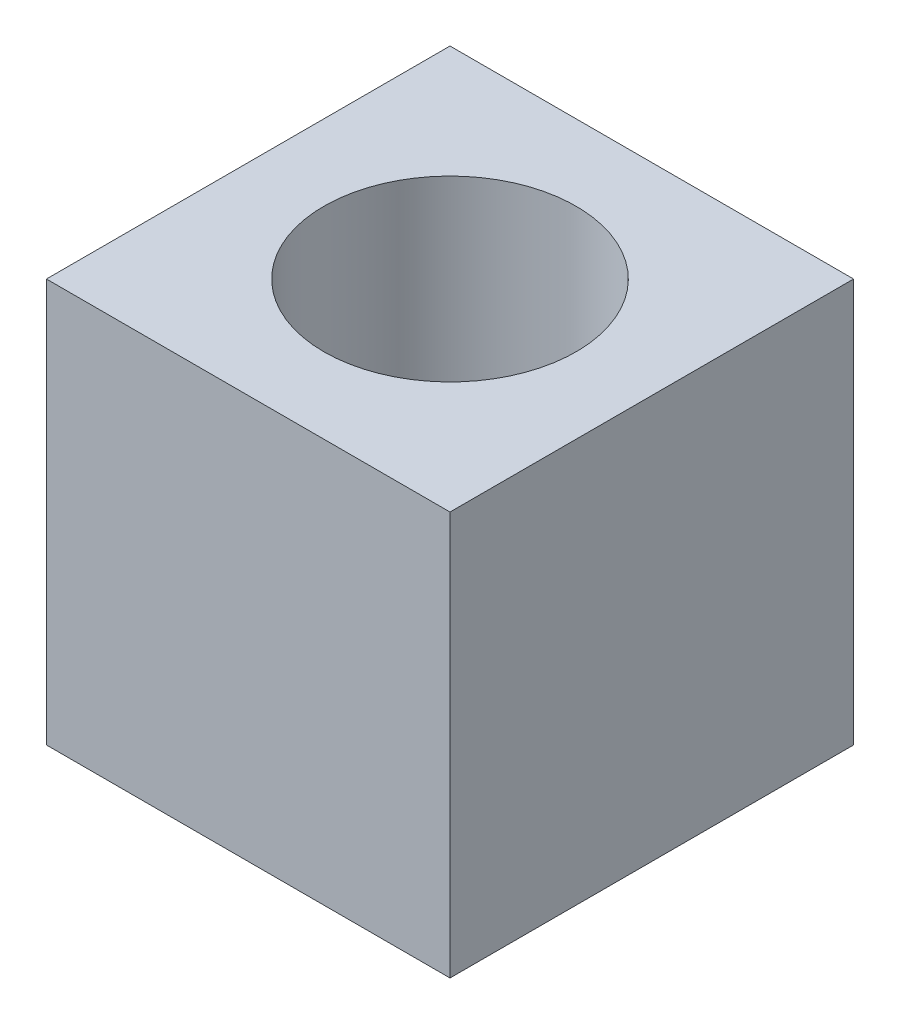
ISO-10303-21;
HEADER;
FILE_DESCRIPTION(('STEP AP214'),'2;1');
FILE_NAME('part.step','',(''),(''),'','','');
FILE_SCHEMA(('AUTOMOTIVE_DESIGN { 1 0 10303 214 1 1 1 1 }'));
ENDSEC;
DATA;
#1=APPLICATION_CONTEXT('core data for automotive mechanical design processes');
#2=APPLICATION_PROTOCOL_DEFINITION('international standard','automotive_design',2000,#1);
#3=PRODUCT_CONTEXT('',#1,'mechanical');
#4=PRODUCT('Part','Part','',(#3));
#5=PRODUCT_RELATED_PRODUCT_CATEGORY('part','',(#4));
#6=PRODUCT_DEFINITION_FORMATION('','',#4);
#7=PRODUCT_DEFINITION_CONTEXT('part definition',#1,'design');
#8=PRODUCT_DEFINITION('design','',#6,#7);
#9=PRODUCT_DEFINITION_SHAPE('','',#8);
#10=(LENGTH_UNIT() NAMED_UNIT(*) SI_UNIT(.MILLI.,.METRE.));
#11=(NAMED_UNIT(*) PLANE_ANGLE_UNIT() SI_UNIT($,.RADIAN.));
#12=(NAMED_UNIT(*) SI_UNIT($,.STERADIAN.) SOLID_ANGLE_UNIT());
#13=UNCERTAINTY_MEASURE_WITH_UNIT(LENGTH_MEASURE(1.E-05),#10,'distance_accuracy_value','');
#14=(GEOMETRIC_REPRESENTATION_CONTEXT(3) GLOBAL_UNCERTAINTY_ASSIGNED_CONTEXT((#13)) GLOBAL_UNIT_ASSIGNED_CONTEXT((#10,
#11,#12)) REPRESENTATION_CONTEXT('',''));
#15=CARTESIAN_POINT('',(0.,0.,0.));
#16=DIRECTION('',(0.,0.,1.));
#17=DIRECTION('',(1.,0.,0.));
#18=AXIS2_PLACEMENT_3D('',#15,#16,#17);
#19=CARTESIAN_POINT('',(-50.8,0.,50.8));
#20=DIRECTION('',(1.,0.,0.));
#21=DIRECTION('',(0.,0.,-1.));
#22=AXIS2_PLACEMENT_3D('',#19,#20,#21);
#23=PLANE('',#22);
#24=DIRECTION('',(0.,-1.,0.));
#25=VECTOR('',#24,1.);
#26=CARTESIAN_POINT('',(-50.8,0.,-50.8));
#27=LINE('',#26,#25);
#28=CARTESIAN_POINT('',(-50.8,101.6,-50.8));
#29=VERTEX_POINT('',#28);
#30=CARTESIAN_POINT('',(-50.8,0.,-50.8));
#31=VERTEX_POINT('',#30);
#32=EDGE_CURVE('E68',#29,#31,#27,.T.);
#33=ORIENTED_EDGE('',*,*,#32,.T.);
#34=DIRECTION('',(0.,0.,-1.));
#35=VECTOR('',#34,1.);
#36=CARTESIAN_POINT('',(-50.8,0.,50.8));
#37=LINE('',#36,#35);
#38=CARTESIAN_POINT('',(-50.8,0.,50.8));
#39=VERTEX_POINT('',#38);
#40=EDGE_CURVE('E11',#39,#31,#37,.T.);
#41=ORIENTED_EDGE('',*,*,#40,.F.);
#42=DIRECTION('',(0.,-1.,0.));
#43=VECTOR('',#42,1.);
#44=CARTESIAN_POINT('',(-50.8,0.,50.8));
#45=LINE('',#44,#43);
#46=CARTESIAN_POINT('',(-50.8,101.6,50.8));
#47=VERTEX_POINT('',#46);
#48=EDGE_CURVE('E91',#47,#39,#45,.T.);
#49=ORIENTED_EDGE('',*,*,#48,.F.);
#50=DIRECTION('',(0.,0.,-1.));
#51=VECTOR('',#50,1.);
#52=CARTESIAN_POINT('',(-50.8,101.6,50.8));
#53=LINE('',#52,#51);
#54=EDGE_CURVE('E80',#47,#29,#53,.T.);
#55=ORIENTED_EDGE('',*,*,#54,.T.);
#56=EDGE_LOOP('',(#33,#41,#49,#55));
#57=FACE_BOUND('',#56,.T.);
#58=ADVANCED_FACE('F24',(#57),#23,.F.);
#59=CARTESIAN_POINT('',(-50.8,0.,50.8));
#60=DIRECTION('',(0.,1.,0.));
#61=DIRECTION('',(0.,0.,1.));
#62=AXIS2_PLACEMENT_3D('',#59,#60,#61);
#63=PLANE('',#62);
#64=CARTESIAN_POINT('',(0.,0.,0.));
#65=DIRECTION('',(0.,1.,0.));
#66=DIRECTION('',(0.,0.,1.));
#67=AXIS2_PLACEMENT_3D('',#64,#65,#66);
#68=CIRCLE('',#67,31.75);
#69=CARTESIAN_POINT('',(0.,0.,31.75));
#70=VERTEX_POINT('',#69);
#71=EDGE_CURVE('E81',#70,#70,#68,.T.);
#72=ORIENTED_EDGE('',*,*,#71,.T.);
#73=EDGE_LOOP('',(#72));
#74=FACE_BOUND('',#73,.T.);
#75=DIRECTION('',(1.,0.,0.));
#76=VECTOR('',#75,1.);
#77=CARTESIAN_POINT('',(-50.8,0.,-50.8));
#78=LINE('',#77,#76);
#79=CARTESIAN_POINT('',(50.8,0.,-50.8));
#80=VERTEX_POINT('',#79);
#81=EDGE_CURVE('E64',#31,#80,#78,.T.);
#82=ORIENTED_EDGE('',*,*,#81,.T.);
#83=DIRECTION('',(0.,0.,-1.));
#84=VECTOR('',#83,1.);
#85=CARTESIAN_POINT('',(50.8,0.,50.8));
#86=LINE('',#85,#84);
#87=CARTESIAN_POINT('',(50.8,0.,50.8));
#88=VERTEX_POINT('',#87);
#89=EDGE_CURVE('E31',#88,#80,#86,.T.);
#90=ORIENTED_EDGE('',*,*,#89,.F.);
#91=DIRECTION('',(1.,0.,0.));
#92=VECTOR('',#91,1.);
#93=CARTESIAN_POINT('',(-50.8,0.,50.8));
#94=LINE('',#93,#92);
#95=EDGE_CURVE('E76',#39,#88,#94,.T.);
#96=ORIENTED_EDGE('',*,*,#95,.F.);
#97=ORIENTED_EDGE('',*,*,#40,.T.);
#98=EDGE_LOOP('',(#82,#90,#96,#97));
#99=FACE_BOUND('',#98,.T.);
#100=ADVANCED_FACE('F75',(#74,#99),#63,.F.);
#101=CARTESIAN_POINT('',(50.8,0.,50.8));
#102=DIRECTION('',(-1.,0.,0.));
#103=DIRECTION('',(0.,0.,1.));
#104=AXIS2_PLACEMENT_3D('',#101,#102,#103);
#105=PLANE('',#104);
#106=DIRECTION('',(0.,1.,0.));
#107=VECTOR('',#106,1.);
#108=CARTESIAN_POINT('',(50.8,0.,-50.8));
#109=LINE('',#108,#107);
#110=CARTESIAN_POINT('',(50.8,101.6,-50.8));
#111=VERTEX_POINT('',#110);
#112=EDGE_CURVE('E69',#80,#111,#109,.T.);
#113=ORIENTED_EDGE('',*,*,#112,.T.);
#114=DIRECTION('',(0.,0.,-1.));
#115=VECTOR('',#114,1.);
#116=CARTESIAN_POINT('',(50.8,101.6,50.8));
#117=LINE('',#116,#115);
#118=CARTESIAN_POINT('',(50.8,101.6,50.8));
#119=VERTEX_POINT('',#118);
#120=EDGE_CURVE('E97',#119,#111,#117,.T.);
#121=ORIENTED_EDGE('',*,*,#120,.F.);
#122=DIRECTION('',(0.,1.,0.));
#123=VECTOR('',#122,1.);
#124=CARTESIAN_POINT('',(50.8,0.,50.8));
#125=LINE('',#124,#123);
#126=EDGE_CURVE('E43',#88,#119,#125,.T.);
#127=ORIENTED_EDGE('',*,*,#126,.F.);
#128=ORIENTED_EDGE('',*,*,#89,.T.);
#129=EDGE_LOOP('',(#113,#121,#127,#128));
#130=FACE_BOUND('',#129,.T.);
#131=ADVANCED_FACE('F100',(#130),#105,.F.);
#132=CARTESIAN_POINT('',(-50.8,101.6,50.8));
#133=DIRECTION('',(0.,-1.,0.));
#134=DIRECTION('',(0.,0.,-1.));
#135=AXIS2_PLACEMENT_3D('',#132,#133,#134);
#136=PLANE('',#135);
#137=CARTESIAN_POINT('',(0.,101.6,0.));
#138=DIRECTION('',(0.,1.,0.));
#139=DIRECTION('',(0.,0.,1.));
#140=AXIS2_PLACEMENT_3D('',#137,#138,#139);
#141=CIRCLE('',#140,31.75);
#142=CARTESIAN_POINT('',(0.,101.6,31.75));
#143=VERTEX_POINT('',#142);
#144=EDGE_CURVE('E84',#143,#143,#141,.T.);
#145=ORIENTED_EDGE('',*,*,#144,.F.);
#146=EDGE_LOOP('',(#145));
#147=FACE_BOUND('',#146,.T.);
#148=DIRECTION('',(-1.,0.,0.));
#149=VECTOR('',#148,1.);
#150=CARTESIAN_POINT('',(-50.8,101.6,-50.8));
#151=LINE('',#150,#149);
#152=EDGE_CURVE('E89',#111,#29,#151,.T.);
#153=ORIENTED_EDGE('',*,*,#152,.T.);
#154=ORIENTED_EDGE('',*,*,#54,.F.);
#155=DIRECTION('',(-1.,0.,0.));
#156=VECTOR('',#155,1.);
#157=CARTESIAN_POINT('',(-50.8,101.6,50.8));
#158=LINE('',#157,#156);
#159=EDGE_CURVE('E38',#119,#47,#158,.T.);
#160=ORIENTED_EDGE('',*,*,#159,.F.);
#161=ORIENTED_EDGE('',*,*,#120,.T.);
#162=EDGE_LOOP('',(#153,#154,#160,#161));
#163=FACE_BOUND('',#162,.T.);
#164=ADVANCED_FACE('F102',(#147,#163),#136,.F.);
#165=CARTESIAN_POINT('',(-50.8,101.6,50.8));
#166=DIRECTION('',(0.,0.,-1.));
#167=DIRECTION('',(-1.,0.,0.));
#168=AXIS2_PLACEMENT_3D('',#165,#166,#167);
#169=PLANE('',#168);
#170=ORIENTED_EDGE('',*,*,#48,.T.);
#171=ORIENTED_EDGE('',*,*,#95,.T.);
#172=ORIENTED_EDGE('',*,*,#126,.T.);
#173=ORIENTED_EDGE('',*,*,#159,.T.);
#174=EDGE_LOOP('',(#170,#171,#172,#173));
#175=FACE_BOUND('',#174,.T.);
#176=ADVANCED_FACE('F103',(#175),#169,.F.);
#177=CARTESIAN_POINT('',(-50.8,101.6,-50.8));
#178=DIRECTION('',(0.,0.,-1.));
#179=DIRECTION('',(-1.,0.,0.));
#180=AXIS2_PLACEMENT_3D('',#177,#178,#179);
#181=PLANE('',#180);
#182=ORIENTED_EDGE('',*,*,#32,.F.);
#183=ORIENTED_EDGE('',*,*,#152,.F.);
#184=ORIENTED_EDGE('',*,*,#112,.F.);
#185=ORIENTED_EDGE('',*,*,#81,.F.);
#186=EDGE_LOOP('',(#182,#183,#184,#185));
#187=FACE_BOUND('',#186,.T.);
#188=ADVANCED_FACE('F65',(#187),#181,.T.);
#189=CARTESIAN_POINT('',(0.,0.,0.));
#190=DIRECTION('',(0.,1.,0.));
#191=DIRECTION('',(0.,0.,1.));
#192=AXIS2_PLACEMENT_3D('',#189,#190,#191);
#193=CYLINDRICAL_SURFACE('',#192,31.75);
#194=ORIENTED_EDGE('',*,*,#71,.F.);
#195=EDGE_LOOP('',(#194));
#196=FACE_BOUND('',#195,.T.);
#197=ORIENTED_EDGE('',*,*,#144,.T.);
#198=EDGE_LOOP('',(#197));
#199=FACE_BOUND('',#198,.T.);
#200=ADVANCED_FACE('F110',(#196,#199),#193,.F.);
#201=CLOSED_SHELL('',(#58,#100,#131,#164,#176,#188,#200));
#202=MANIFOLD_SOLID_BREP('B2',#201);
#203=ADVANCED_BREP_SHAPE_REPRESENTATION('',(#18,#202),#14);
#204=SHAPE_DEFINITION_REPRESENTATION(#9,#203);
ENDSEC;
END-ISO-10303-21;
